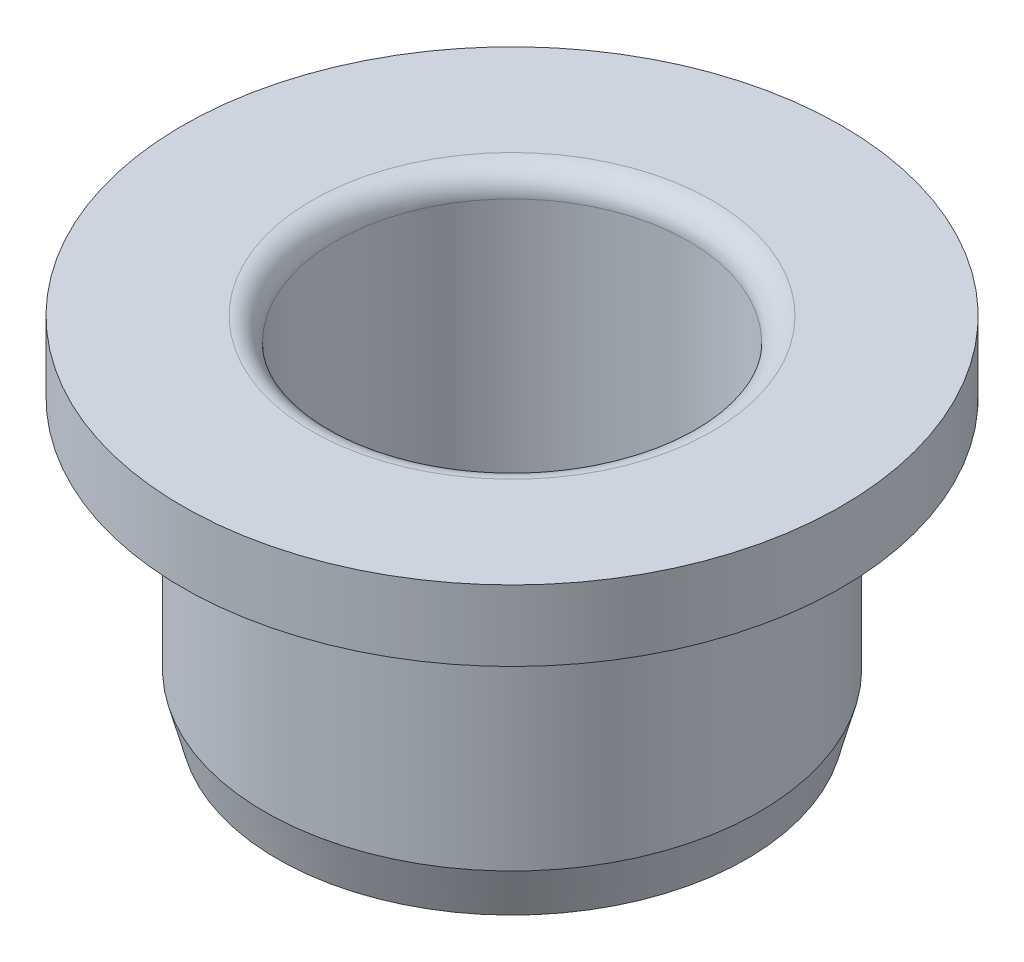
from build123d import *


with BuildPart() as part:
    # Esquisse1 → R_volution1 (revolve)
    with BuildSketch(Plane.XY, mode=Mode.PRIVATE) as r_volution1_sk:
        with BuildLine():
            Line((14, 12), (11, 12))
            ThreePointArc((11, 12), (10.646446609, 11.853553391), (10.5, 11.5))
            Line((10.5, 11.5), (10.5, 2))
            Line((10.5, 2), (9.964101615, 0))
            Line((9.964101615, 0), (8.5, 0))
            ThreePointArc((8.5, 0), (7.792893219, 0.292893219), (7.5, 1))
            Line((7.5, 1), (7.5, 14))
            ThreePointArc((7.5, 14), (7.792893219, 14.707106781), (8.5, 15))
            Line((8.5, 15), (14, 15))
            Line((14, 15), (14, 12))
        make_face()
    revolve(r_volution1_sk.sketch.rotate(Axis((0, 0, 0), (0, 1, 0)), 90), axis=Axis((0, 0, 0), (0, 1, 0)))


solid = part.part
